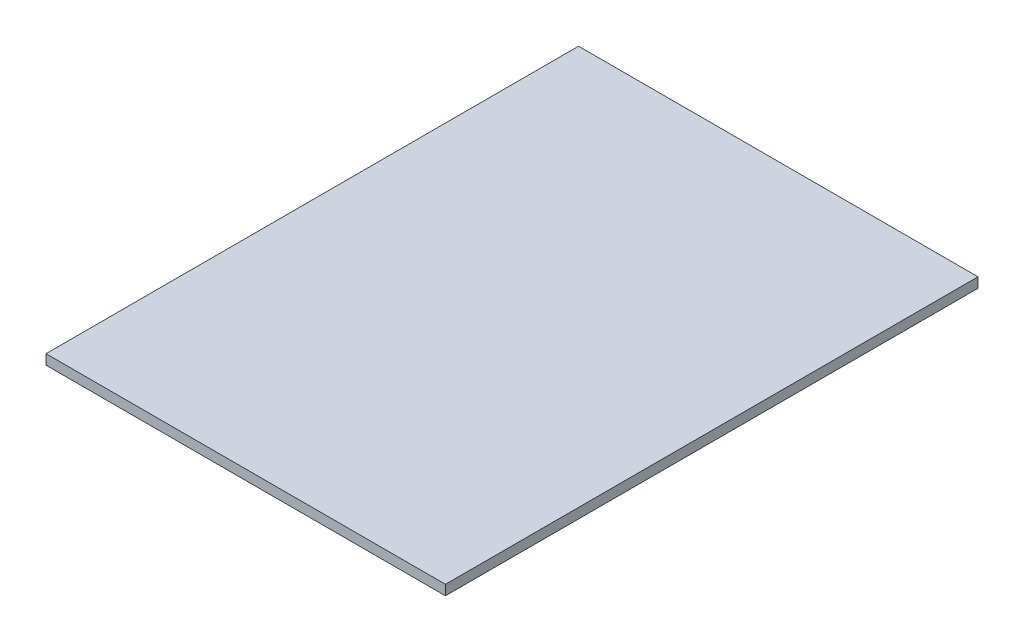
from build123d import *

# Parameters (mm, degrees)
SKETCH1_W      = 3048
SKETCH1_H      = 4064
EXTRUDE1_DEPTH = 76.2


with BuildPart() as part:
    # Sketch1 → Extrude1 (new body)
    with BuildSketch(Plane(origin=(0, 0, 0), x_dir=(1, 0, 0), z_dir=(0, 1, 0))):
        with Locations((1524, 2032)):
            Rectangle(SKETCH1_W, SKETCH1_H)
    extrude(amount=EXTRUDE1_DEPTH)


solid = part.part
